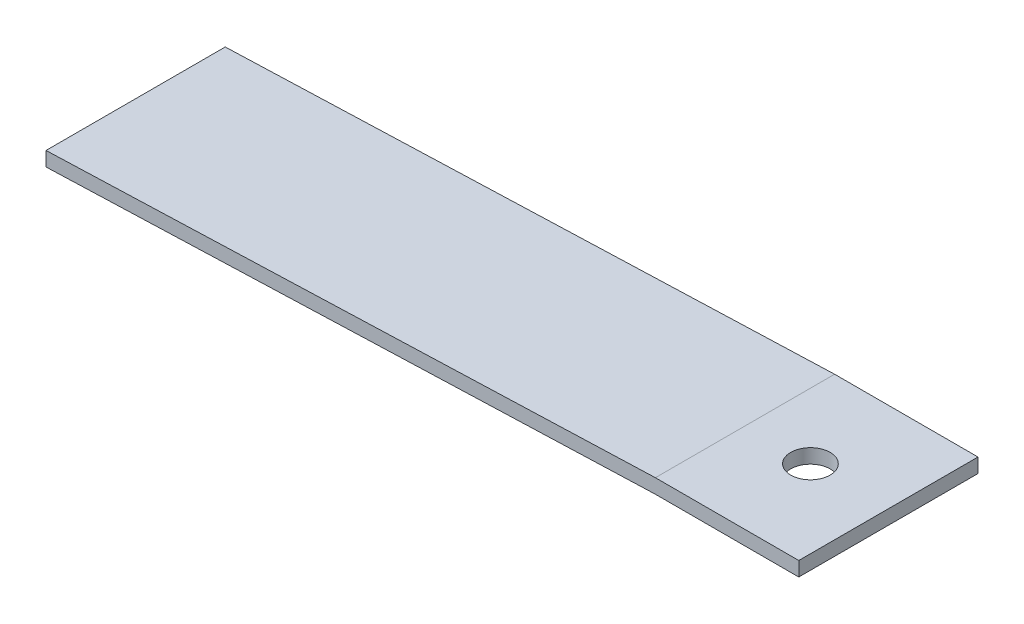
from build123d import *

# Parameters (mm, degrees)
BOSS_EXTRUDE1_DEPTH = 5
SKETCH2_R           = 1.1
CUT_EXTRUDE1_DEPTH  = 10


with BuildPart() as part:
    # Sketch1 → Boss-Extrude1 (new, symmetric)
    with BuildSketch(Plane.XY):
        Polygon((0, 0), (-34, -1.187306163), (-34, -0.387306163), (0, 0.8), (8, 0.8), (8, 0), align=None)
    extrude(amount=BOSS_EXTRUDE1_DEPTH, both=True)

    # Sketch2 → Cut-Extrude1 (cut)
    with BuildSketch(Plane(origin=(0, 0.8, 0), x_dir=(1, 0, 0), z_dir=(0, 1, 0))):
        with Locations(Location((3.65, 0, 0), (0, 0, 270))):
            Circle(SKETCH2_R)
    extrude(amount=-CUT_EXTRUDE1_DEPTH, mode=Mode.SUBTRACT)


solid = part.part
